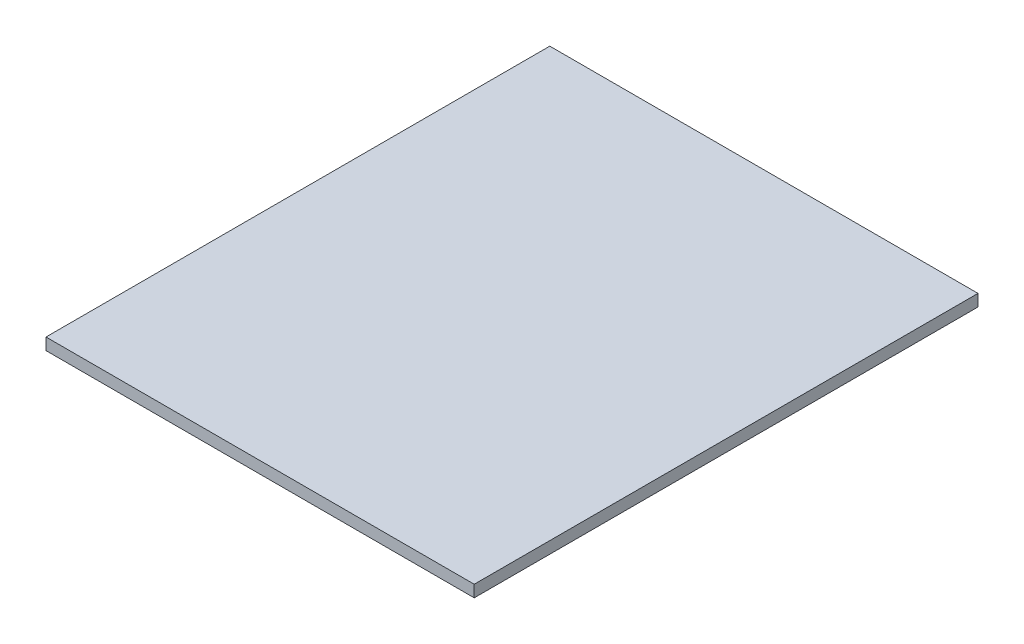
from build123d import *

# Parameters (mm, degrees)
SKETCH1_W           = 431.8
SKETCH1_H           = 508
BOSS_EXTRUDE1_DEPTH = 11.90625


with BuildPart() as part:
    # Sketch1 → Boss-Extrude1 (new body)
    with BuildSketch(Plane(origin=(0, 0, 0), x_dir=(1, 0, 0), z_dir=(0, 1, 0))):
        Rectangle(SKETCH1_W, SKETCH1_H)
    extrude(amount=BOSS_EXTRUDE1_DEPTH)


solid = part.part
